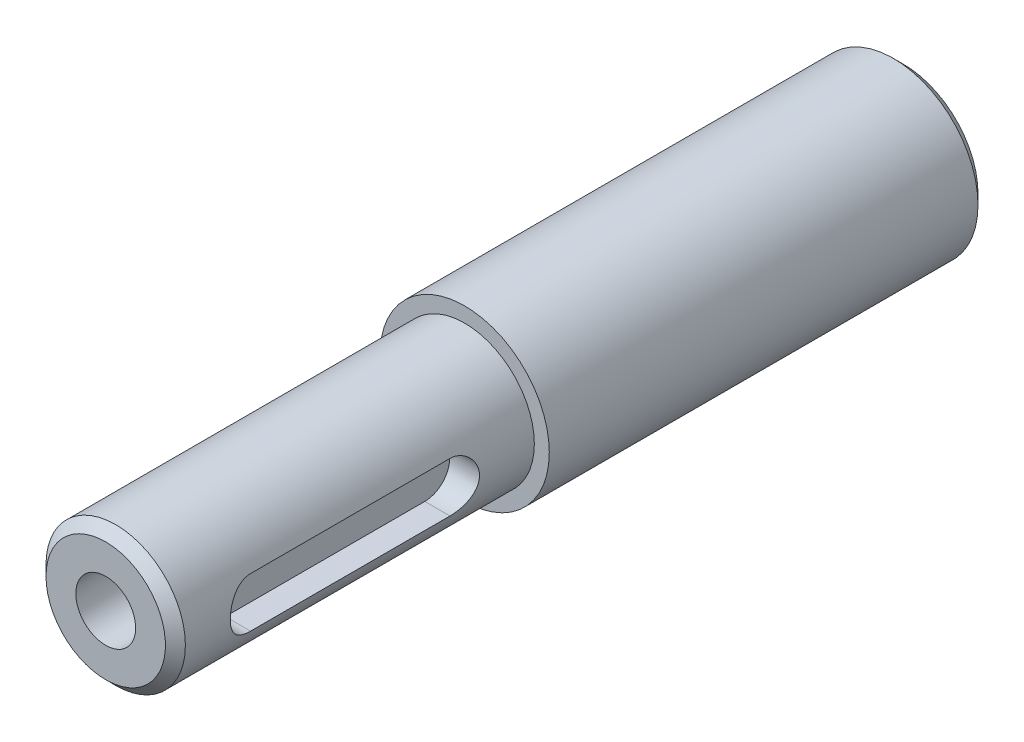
ISO-10303-21;
HEADER;
FILE_DESCRIPTION(('STEP AP214'),'2;1');
FILE_NAME('part.step','',(''),(''),'','','');
FILE_SCHEMA(('AUTOMOTIVE_DESIGN { 1 0 10303 214 1 1 1 1 }'));
ENDSEC;
DATA;
#1=APPLICATION_CONTEXT('core data for automotive mechanical design processes');
#2=APPLICATION_PROTOCOL_DEFINITION('international standard','automotive_design',2000,#1);
#3=PRODUCT_CONTEXT('',#1,'mechanical');
#4=PRODUCT('Part','Part','',(#3));
#5=PRODUCT_RELATED_PRODUCT_CATEGORY('part','',(#4));
#6=PRODUCT_DEFINITION_FORMATION('','',#4);
#7=PRODUCT_DEFINITION_CONTEXT('part definition',#1,'design');
#8=PRODUCT_DEFINITION('design','',#6,#7);
#9=PRODUCT_DEFINITION_SHAPE('','',#8);
#10=(LENGTH_UNIT() NAMED_UNIT(*) SI_UNIT(.MILLI.,.METRE.));
#11=(NAMED_UNIT(*) PLANE_ANGLE_UNIT() SI_UNIT($,.RADIAN.));
#12=(NAMED_UNIT(*) SI_UNIT($,.STERADIAN.) SOLID_ANGLE_UNIT());
#13=UNCERTAINTY_MEASURE_WITH_UNIT(LENGTH_MEASURE(1.E-05),#10,'distance_accuracy_value','');
#14=(GEOMETRIC_REPRESENTATION_CONTEXT(3) GLOBAL_UNCERTAINTY_ASSIGNED_CONTEXT((#13)) GLOBAL_UNIT_ASSIGNED_CONTEXT((#10,
#11,#12)) REPRESENTATION_CONTEXT('',''));
#15=CARTESIAN_POINT('',(0.,0.,0.));
#16=DIRECTION('',(0.,0.,1.));
#17=DIRECTION('',(1.,0.,0.));
#18=AXIS2_PLACEMENT_3D('',#15,#16,#17);
#19=CARTESIAN_POINT('',(0.,0.,55.));
#20=DIRECTION('',(0.,0.,1.));
#21=DIRECTION('',(1.,0.,0.));
#22=AXIS2_PLACEMENT_3D('',#19,#20,#21);
#23=CONICAL_SURFACE('',#22,3.,1.02974425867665);
#24=CARTESIAN_POINT('',(0.,0.,53.1974181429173));
#25=VERTEX_POINT('',#24);
#26=VERTEX_LOOP('',#25);
#27=FACE_BOUND('',#26,.T.);
#28=CARTESIAN_POINT('',(0.,0.,55.));
#29=DIRECTION('',(0.,0.,1.));
#30=DIRECTION('',(1.,0.,0.));
#31=AXIS2_PLACEMENT_3D('',#28,#29,#30);
#32=CIRCLE('',#31,3.);
#33=CARTESIAN_POINT('',(3.,0.,55.));
#34=VERTEX_POINT('',#33);
#35=EDGE_CURVE('E67',#34,#34,#32,.T.);
#36=ORIENTED_EDGE('',*,*,#35,.T.);
#37=EDGE_LOOP('',(#36));
#38=FACE_BOUND('',#37,.T.);
#39=ADVANCED_FACE('F16',(#27,#38),#23,.F.);
#40=CARTESIAN_POINT('',(0.,0.,80.));
#41=DIRECTION('',(0.,0.,-1.));
#42=DIRECTION('',(0.,1.,0.));
#43=AXIS2_PLACEMENT_3D('',#40,#41,#42);
#44=CYLINDRICAL_SURFACE('',#43,3.);
#45=ORIENTED_EDGE('',*,*,#35,.F.);
#46=EDGE_LOOP('',(#45));
#47=FACE_BOUND('',#46,.T.);
#48=CARTESIAN_POINT('',(0.,0.,80.));
#49=DIRECTION('',(0.,0.,-1.));
#50=DIRECTION('',(0.,1.,0.));
#51=AXIS2_PLACEMENT_3D('',#48,#49,#50);
#52=CIRCLE('',#51,3.);
#53=CARTESIAN_POINT('',(0.,3.,80.));
#54=VERTEX_POINT('',#53);
#55=EDGE_CURVE('E20',#54,#54,#52,.F.);
#56=ORIENTED_EDGE('',*,*,#55,.T.);
#57=EDGE_LOOP('',(#56));
#58=FACE_BOUND('',#57,.T.);
#59=ADVANCED_FACE('F18',(#47,#58),#44,.F.);
#60=CARTESIAN_POINT('',(4.,0.,62.));
#61=DIRECTION('',(1.,0.,0.));
#62=DIRECTION('',(0.,0.,-1.));
#63=AXIS2_PLACEMENT_3D('',#60,#61,#62);
#64=PLANE('',#63);
#65=CARTESIAN_POINT('',(4.,0.,52.));
#66=DIRECTION('',(1.,0.,0.));
#67=DIRECTION('',(0.,0.,-1.));
#68=AXIS2_PLACEMENT_3D('',#65,#66,#67);
#69=CIRCLE('',#68,2.5);
#70=CARTESIAN_POINT('',(4.,-2.5,52.));
#71=VERTEX_POINT('',#70);
#72=CARTESIAN_POINT('',(4.,2.5,52.));
#73=VERTEX_POINT('',#72);
#74=EDGE_CURVE('E59',#71,#73,#69,.T.);
#75=ORIENTED_EDGE('',*,*,#74,.T.);
#76=DIRECTION('',(0.,0.,1.));
#77=VECTOR('',#76,1.);
#78=CARTESIAN_POINT('',(4.,2.5,72.));
#79=LINE('',#78,#77);
#80=CARTESIAN_POINT('',(4.,2.5,72.));
#81=VERTEX_POINT('',#80);
#82=EDGE_CURVE('E71',#73,#81,#79,.T.);
#83=ORIENTED_EDGE('',*,*,#82,.T.);
#84=CARTESIAN_POINT('',(4.,0.,72.));
#85=DIRECTION('',(1.,0.,0.));
#86=DIRECTION('',(0.,0.,-1.));
#87=AXIS2_PLACEMENT_3D('',#84,#85,#86);
#88=CIRCLE('',#87,2.5);
#89=CARTESIAN_POINT('',(4.,-2.5,72.));
#90=VERTEX_POINT('',#89);
#91=EDGE_CURVE('E221',#81,#90,#88,.T.);
#92=ORIENTED_EDGE('',*,*,#91,.T.);
#93=DIRECTION('',(0.,0.,-1.));
#94=VECTOR('',#93,1.);
#95=CARTESIAN_POINT('',(4.,-2.5,52.));
#96=LINE('',#95,#94);
#97=EDGE_CURVE('E57',#90,#71,#96,.T.);
#98=ORIENTED_EDGE('',*,*,#97,.T.);
#99=EDGE_LOOP('',(#75,#83,#92,#98));
#100=FACE_BOUND('',#99,.T.);
#101=ADVANCED_FACE('F194',(#100),#64,.T.);
#102=CARTESIAN_POINT('',(0.,0.,80.));
#103=DIRECTION('',(0.,0.,-1.));
#104=DIRECTION('',(-1.,0.,0.));
#105=AXIS2_PLACEMENT_3D('',#102,#103,#104);
#106=PLANE('',#105);
#107=ORIENTED_EDGE('',*,*,#55,.F.);
#108=EDGE_LOOP('',(#107));
#109=FACE_BOUND('',#108,.T.);
#110=CARTESIAN_POINT('',(0.,0.,80.0000000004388));
#111=DIRECTION('',(0.,0.,-1.));
#112=DIRECTION('',(-1.,0.,0.));
#113=AXIS2_PLACEMENT_3D('',#110,#111,#112);
#114=CIRCLE('',#113,5.9900000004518);
#115=CARTESIAN_POINT('',(-5.9900000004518,0.,80.0000000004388));
#116=VERTEX_POINT('',#115);
#117=EDGE_CURVE('E217',#116,#116,#114,.T.);
#118=ORIENTED_EDGE('',*,*,#117,.F.);
#119=EDGE_LOOP('',(#118));
#120=FACE_BOUND('',#119,.T.);
#121=ADVANCED_FACE('F186',(#109,#120),#106,.F.);
#122=CARTESIAN_POINT('',(4.,2.5,72.));
#123=DIRECTION('',(0.,1.,0.));
#124=DIRECTION('',(0.,0.,1.));
#125=AXIS2_PLACEMENT_3D('',#122,#123,#124);
#126=PLANE('',#125);
#127=DIRECTION('',(1.,0.,0.));
#128=VECTOR('',#127,1.);
#129=CARTESIAN_POINT('',(4.,2.5,72.));
#130=LINE('',#129,#128);
#131=CARTESIAN_POINT('',(6.52764122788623,2.5,72.));
#132=VERTEX_POINT('',#131);
#133=EDGE_CURVE('E224',#132,#81,#130,.F.);
#134=ORIENTED_EDGE('',*,*,#133,.T.);
#135=ORIENTED_EDGE('',*,*,#82,.F.);
#136=DIRECTION('',(1.,0.,0.));
#137=VECTOR('',#136,1.);
#138=CARTESIAN_POINT('',(4.,2.5,52.));
#139=LINE('',#138,#137);
#140=CARTESIAN_POINT('',(6.52764122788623,2.5,52.));
#141=VERTEX_POINT('',#140);
#142=EDGE_CURVE('E225',#73,#141,#139,.T.);
#143=ORIENTED_EDGE('',*,*,#142,.T.);
#144=DIRECTION('',(0.,0.,1.));
#145=VECTOR('',#144,1.);
#146=CARTESIAN_POINT('',(6.52764122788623,2.5,44.));
#147=LINE('',#146,#145);
#148=EDGE_CURVE('E218',#132,#141,#147,.F.);
#149=ORIENTED_EDGE('',*,*,#148,.F.);
#150=EDGE_LOOP('',(#134,#135,#143,#149));
#151=FACE_BOUND('',#150,.T.);
#152=ADVANCED_FACE('F179',(#151),#126,.F.);
#153=CARTESIAN_POINT('',(4.,0.,52.));
#154=DIRECTION('',(1.,0.,0.));
#155=DIRECTION('',(0.,0.,-1.));
#156=AXIS2_PLACEMENT_3D('',#153,#154,#155);
#157=CYLINDRICAL_SURFACE('',#156,2.5);
#158=ORIENTED_EDGE('',*,*,#142,.F.);
#159=ORIENTED_EDGE('',*,*,#74,.F.);
#160=DIRECTION('',(1.,0.,0.));
#161=VECTOR('',#160,1.);
#162=CARTESIAN_POINT('',(4.,-2.5,52.));
#163=LINE('',#162,#161);
#164=CARTESIAN_POINT('',(6.52764122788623,-2.5,52.));
#165=VERTEX_POINT('',#164);
#166=EDGE_CURVE('E231',#71,#165,#163,.T.);
#167=ORIENTED_EDGE('',*,*,#166,.T.);
#168=CARTESIAN_POINT('',(6.52764122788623,2.5,52.));
#169=CARTESIAN_POINT('',(6.52762932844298,2.50000932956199,51.9321178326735));
#170=CARTESIAN_POINT('',(6.52869982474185,2.49723542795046,51.8642422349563));
#171=CARTESIAN_POINT('',(6.53291691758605,2.48619392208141,51.7290245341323));
#172=CARTESIAN_POINT('',(6.53606287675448,2.47792800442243,51.6616822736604));
#173=CARTESIAN_POINT('',(6.54432869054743,2.45601124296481,51.5282291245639));
#174=CARTESIAN_POINT('',(6.54944201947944,2.44237819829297,51.4621149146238));
#175=CARTESIAN_POINT('',(6.56147229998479,2.40987135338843,51.3313718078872));
#176=CARTESIAN_POINT('',(6.5683893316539,2.39099732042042,51.2667429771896));
#177=CARTESIAN_POINT('',(6.59153147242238,2.3267801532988,51.0758402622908));
#178=CARTESIAN_POINT('',(6.61016236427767,2.27380524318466,50.9523295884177));
#179=CARTESIAN_POINT('',(6.65171798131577,2.14919483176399,50.7159177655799));
#180=CARTESIAN_POINT('',(6.67464584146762,2.07754569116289,50.6030244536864));
#181=CARTESIAN_POINT('',(6.72336274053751,1.91416778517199,50.3859538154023));
#182=CARTESIAN_POINT('',(6.74923032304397,1.82173941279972,50.2823195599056));
#183=CARTESIAN_POINT('',(6.80025349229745,1.62091775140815,50.0916479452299));
#184=CARTESIAN_POINT('',(6.82540894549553,1.51252149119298,50.0046136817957));
#185=CARTESIAN_POINT('',(6.87310216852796,1.27875147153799,49.8470357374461));
#186=CARTESIAN_POINT('',(6.89553639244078,1.15295997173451,49.7770775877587));
#187=CARTESIAN_POINT('',(6.93431732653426,0.890455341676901,49.6595405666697));
#188=CARTESIAN_POINT('',(6.95066612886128,0.753745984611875,49.6119540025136));
#189=CARTESIAN_POINT('',(6.97487541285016,0.479024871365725,49.5423975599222));
#190=CARTESIAN_POINT('',(6.98304624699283,0.341278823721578,49.5194883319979));
#191=CARTESIAN_POINT('',(6.99108762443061,0.0636687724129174,49.4969369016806));
#192=CARTESIAN_POINT('',(6.99096047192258,-0.0761946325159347,49.4972882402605));
#193=CARTESIAN_POINT('',(6.98262286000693,-0.347368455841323,49.5206807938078));
#194=CARTESIAN_POINT('',(6.97477696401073,-0.478780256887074,49.5426986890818));
#195=CARTESIAN_POINT('',(6.95235298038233,-0.735901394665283,49.6070901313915));
#196=CARTESIAN_POINT('',(6.93777451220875,-0.861610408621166,49.6494648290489));
#197=CARTESIAN_POINT('',(6.90308940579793,-1.10584718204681,49.7538935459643));
#198=CARTESIAN_POINT('',(6.88290798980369,-1.22424926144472,49.816215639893));
#199=CARTESIAN_POINT('',(6.83908468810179,-1.44919738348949,49.9585408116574));
#200=CARTESIAN_POINT('',(6.81544174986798,-1.55573980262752,50.0385492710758));
#201=CARTESIAN_POINT('',(6.76566074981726,-1.75999327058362,50.2189963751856));
#202=CARTESIAN_POINT('',(6.73945687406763,-1.85692513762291,50.3203000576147));
#203=CARTESIAN_POINT('',(6.68853967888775,-2.03271605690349,50.5379342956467));
#204=CARTESIAN_POINT('',(6.6638268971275,-2.11156861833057,50.6542702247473));
#205=CARTESIAN_POINT('',(6.61829017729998,-2.25028518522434,50.9015041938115));
#206=CARTESIAN_POINT('',(6.5975494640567,-2.30975805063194,51.0326377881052));
#207=CARTESIAN_POINT('',(6.56327947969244,-2.40542819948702,51.3039263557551));
#208=CARTESIAN_POINT('',(6.54973844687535,-2.44166346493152,51.4440661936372));
#209=CARTESIAN_POINT('',(6.53641062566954,-2.47700740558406,51.6546749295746));
#210=CARTESIAN_POINT('',(6.53313324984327,-2.4856236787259,51.7234505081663));
#211=CARTESIAN_POINT('',(6.52874601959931,-2.49711753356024,51.8614711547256));
#212=CARTESIAN_POINT('',(6.52763377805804,-2.50000143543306,51.9307156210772));
#213=CARTESIAN_POINT('',(6.52764122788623,-2.5,52.));
#214=B_SPLINE_CURVE_WITH_KNOTS('',3,(#168,#169,#170,#171,#172,#173,#174,#175,#176,#177,#178,
#179,#180,#181,#182,#183,#184,#185,#186,#187,#188,#189,#190,#191,#192,#193,#194,#195,#196,#197,
#198,#199,#200,#201,#202,#203,#204,#205,#206,#207,#208,#209,#210,#211,#212,#213),.UNSPECIFIED.,
.F.,.F.,(4,2,2,2,2,2,2,2,2,2,2,2,2,2,2,2,2,2,2,2,2,2,4),(0.,0.20357036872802,0.407078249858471,
0.609916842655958,0.812764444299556,1.21779583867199,1.62312389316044,2.04497874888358,
2.46691219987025,2.90174567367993,3.33642951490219,3.75390878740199,4.17127213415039,
4.5698254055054,4.96840120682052,5.37257581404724,5.77687357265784,6.20283626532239,
6.62895164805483,7.06319987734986,7.49673650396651,7.7046723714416,7.91237885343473),.UNSPECIFIED.);
#215=EDGE_CURVE('E95',#141,#165,#214,.T.);
#216=ORIENTED_EDGE('',*,*,#215,.F.);
#217=EDGE_LOOP('',(#158,#159,#167,#216));
#218=FACE_BOUND('',#217,.T.);
#219=ADVANCED_FACE('F173',(#218),#157,.F.);
#220=CARTESIAN_POINT('',(4.,-2.5,52.));
#221=DIRECTION('',(0.,-1.,0.));
#222=DIRECTION('',(0.,0.,-1.));
#223=AXIS2_PLACEMENT_3D('',#220,#221,#222);
#224=PLANE('',#223);
#225=ORIENTED_EDGE('',*,*,#166,.F.);
#226=ORIENTED_EDGE('',*,*,#97,.F.);
#227=DIRECTION('',(1.,0.,0.));
#228=VECTOR('',#227,1.);
#229=CARTESIAN_POINT('',(4.,-2.5,72.));
#230=LINE('',#229,#228);
#231=CARTESIAN_POINT('',(6.52764122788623,-2.5,72.));
#232=VERTEX_POINT('',#231);
#233=EDGE_CURVE('E35',#90,#232,#230,.T.);
#234=ORIENTED_EDGE('',*,*,#233,.T.);
#235=DIRECTION('',(0.,0.,1.));
#236=VECTOR('',#235,1.);
#237=CARTESIAN_POINT('',(6.52764122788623,-2.5,44.));
#238=LINE('',#237,#236);
#239=EDGE_CURVE('E94',#165,#232,#238,.T.);
#240=ORIENTED_EDGE('',*,*,#239,.F.);
#241=EDGE_LOOP('',(#225,#226,#234,#240));
#242=FACE_BOUND('',#241,.T.);
#243=ADVANCED_FACE('F120',(#242),#224,.F.);
#244=CARTESIAN_POINT('',(4.,0.,72.));
#245=DIRECTION('',(1.,0.,0.));
#246=DIRECTION('',(0.,0.,-1.));
#247=AXIS2_PLACEMENT_3D('',#244,#245,#246);
#248=CYLINDRICAL_SURFACE('',#247,2.5);
#249=ORIENTED_EDGE('',*,*,#233,.F.);
#250=ORIENTED_EDGE('',*,*,#91,.F.);
#251=ORIENTED_EDGE('',*,*,#133,.F.);
#252=CARTESIAN_POINT('',(6.52764122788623,-2.5,72.));
#253=CARTESIAN_POINT('',(6.52762932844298,-2.50000932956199,72.0678821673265));
#254=CARTESIAN_POINT('',(6.52869982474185,-2.49723542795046,72.1357577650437));
#255=CARTESIAN_POINT('',(6.53291691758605,-2.48619392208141,72.2709754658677));
#256=CARTESIAN_POINT('',(6.53606287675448,-2.47792800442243,72.3383177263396));
#257=CARTESIAN_POINT('',(6.54432869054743,-2.45601124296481,72.4717708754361));
#258=CARTESIAN_POINT('',(6.54944201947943,-2.44237819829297,72.5378850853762));
#259=CARTESIAN_POINT('',(6.56147229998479,-2.40987135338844,72.6686281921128));
#260=CARTESIAN_POINT('',(6.5683893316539,-2.39099732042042,72.7332570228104));
#261=CARTESIAN_POINT('',(6.59153147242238,-2.3267801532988,72.9241597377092));
#262=CARTESIAN_POINT('',(6.61016236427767,-2.27380524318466,73.0476704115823));
#263=CARTESIAN_POINT('',(6.65171798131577,-2.14919483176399,73.2840822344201));
#264=CARTESIAN_POINT('',(6.67464584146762,-2.07754569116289,73.3969755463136));
#265=CARTESIAN_POINT('',(6.72336274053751,-1.914167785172,73.6140461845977));
#266=CARTESIAN_POINT('',(6.74923032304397,-1.82173941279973,73.7176804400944));
#267=CARTESIAN_POINT('',(6.80025349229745,-1.62091775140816,73.9083520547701));
#268=CARTESIAN_POINT('',(6.82540894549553,-1.51252149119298,73.9953863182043));
#269=CARTESIAN_POINT('',(6.87310216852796,-1.27875147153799,74.152964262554));
#270=CARTESIAN_POINT('',(6.89553639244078,-1.1529599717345,74.2229224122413));
#271=CARTESIAN_POINT('',(6.93431732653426,-0.890455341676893,74.3404594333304));
#272=CARTESIAN_POINT('',(6.95066612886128,-0.753745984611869,74.3880459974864));
#273=CARTESIAN_POINT('',(6.97487541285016,-0.47902487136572,74.4576024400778));
#274=CARTESIAN_POINT('',(6.98304624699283,-0.341278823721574,74.4805116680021));
#275=CARTESIAN_POINT('',(6.99108762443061,-0.0636687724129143,74.5030630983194));
#276=CARTESIAN_POINT('',(6.99096047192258,0.0761946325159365,74.5027117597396));
#277=CARTESIAN_POINT('',(6.98262286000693,0.347368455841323,74.4793192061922));
#278=CARTESIAN_POINT('',(6.97477696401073,0.478780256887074,74.4573013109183));
#279=CARTESIAN_POINT('',(6.95235298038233,0.735901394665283,74.3929098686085));
#280=CARTESIAN_POINT('',(6.93777451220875,0.861610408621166,74.3505351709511));
#281=CARTESIAN_POINT('',(6.90308940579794,1.10584718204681,74.2461064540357));
#282=CARTESIAN_POINT('',(6.88290798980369,1.22424926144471,74.183784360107));
#283=CARTESIAN_POINT('',(6.83908468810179,1.44919738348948,74.0414591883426));
#284=CARTESIAN_POINT('',(6.81544174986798,1.55573980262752,73.9614507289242));
#285=CARTESIAN_POINT('',(6.76566074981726,1.75999327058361,73.7810036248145));
#286=CARTESIAN_POINT('',(6.73945687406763,1.85692513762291,73.6796999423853));
#287=CARTESIAN_POINT('',(6.68853967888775,2.03271605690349,73.4620657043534));
#288=CARTESIAN_POINT('',(6.6638268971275,2.11156861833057,73.3457297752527));
#289=CARTESIAN_POINT('',(6.61829017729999,2.25028518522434,73.0984958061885));
#290=CARTESIAN_POINT('',(6.5975494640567,2.30975805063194,72.9673622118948));
#291=CARTESIAN_POINT('',(6.56327947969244,2.40542819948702,72.6960736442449));
#292=CARTESIAN_POINT('',(6.54973844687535,2.44166346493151,72.5559338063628));
#293=CARTESIAN_POINT('',(6.53641062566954,2.47700740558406,72.3453250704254));
#294=CARTESIAN_POINT('',(6.53313324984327,2.4856236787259,72.2765494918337));
#295=CARTESIAN_POINT('',(6.52874601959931,2.49711753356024,72.1385288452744));
#296=CARTESIAN_POINT('',(6.52763377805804,2.50000143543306,72.0692843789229));
#297=CARTESIAN_POINT('',(6.52764122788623,2.5,72.));
#298=B_SPLINE_CURVE_WITH_KNOTS('',3,(#252,#253,#254,#255,#256,#257,#258,#259,#260,#261,#262,
#263,#264,#265,#266,#267,#268,#269,#270,#271,#272,#273,#274,#275,#276,#277,#278,#279,#280,#281,
#282,#283,#284,#285,#286,#287,#288,#289,#290,#291,#292,#293,#294,#295,#296,#297),.UNSPECIFIED.,
.F.,.F.,(4,2,2,2,2,2,2,2,2,2,2,2,2,2,2,2,2,2,2,2,2,2,4),(0.,0.20357036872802,0.407078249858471,
0.609916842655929,0.812764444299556,1.21779583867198,1.62312389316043,2.04497874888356,
2.46691219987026,2.90174567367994,3.3364295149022,3.75390878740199,4.17127213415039,
4.5698254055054,4.96840120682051,5.37257581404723,5.77687357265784,6.2028362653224,
6.62895164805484,7.06319987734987,7.4967365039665,7.70467237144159,7.91237885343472),.UNSPECIFIED.);
#299=EDGE_CURVE('E86',#232,#132,#298,.T.);
#300=ORIENTED_EDGE('',*,*,#299,.F.);
#301=EDGE_LOOP('',(#249,#250,#251,#300));
#302=FACE_BOUND('',#301,.T.);
#303=ADVANCED_FACE('F101',(#302),#248,.F.);
#304=CARTESIAN_POINT('',(0.,0.,78.999999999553));
#305=DIRECTION('',(0.,0.,-1.));
#306=DIRECTION('',(-1.,0.,0.));
#307=AXIS2_PLACEMENT_3D('',#304,#305,#306);
#308=CONICAL_SURFACE('',#307,6.9899999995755,0.785398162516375);
#309=CARTESIAN_POINT('',(0.,0.,79.));
#310=DIRECTION('',(0.,0.,1.));
#311=DIRECTION('',(1.,0.,0.));
#312=AXIS2_PLACEMENT_3D('',#309,#310,#311);
#313=CIRCLE('',#312,6.99);
#314=CARTESIAN_POINT('',(6.99,0.,79.));
#315=VERTEX_POINT('',#314);
#316=EDGE_CURVE('E85',#315,#315,#313,.F.);
#317=ORIENTED_EDGE('',*,*,#316,.F.);
#318=EDGE_LOOP('',(#317));
#319=FACE_BOUND('',#318,.T.);
#320=ORIENTED_EDGE('',*,*,#117,.T.);
#321=EDGE_LOOP('',(#320));
#322=FACE_BOUND('',#321,.T.);
#323=ADVANCED_FACE('F110',(#319,#322),#308,.T.);
#324=CARTESIAN_POINT('',(0.,0.,44.));
#325=DIRECTION('',(0.,0.,1.));
#326=DIRECTION('',(1.,0.,0.));
#327=AXIS2_PLACEMENT_3D('',#324,#325,#326);
#328=CYLINDRICAL_SURFACE('',#327,6.99);
#329=ORIENTED_EDGE('',*,*,#316,.T.);
#330=EDGE_LOOP('',(#329));
#331=FACE_BOUND('',#330,.T.);
#332=ORIENTED_EDGE('',*,*,#239,.T.);
#333=ORIENTED_EDGE('',*,*,#299,.T.);
#334=ORIENTED_EDGE('',*,*,#148,.T.);
#335=ORIENTED_EDGE('',*,*,#215,.T.);
#336=EDGE_LOOP('',(#332,#333,#334,#335));
#337=FACE_BOUND('',#336,.T.);
#338=CARTESIAN_POINT('',(0.,0.,44.));
#339=DIRECTION('',(0.,0.,1.));
#340=DIRECTION('',(1.,0.,0.));
#341=AXIS2_PLACEMENT_3D('',#338,#339,#340);
#342=CIRCLE('',#341,6.99);
#343=CARTESIAN_POINT('',(6.99,0.,44.));
#344=VERTEX_POINT('',#343);
#345=EDGE_CURVE('E82',#344,#344,#342,.T.);
#346=ORIENTED_EDGE('',*,*,#345,.T.);
#347=EDGE_LOOP('',(#346));
#348=FACE_BOUND('',#347,.T.);
#349=ADVANCED_FACE('F105',(#331,#337,#348),#328,.T.);
#350=CARTESIAN_POINT('',(0.,0.,0.));
#351=DIRECTION('',(0.,0.,-1.));
#352=DIRECTION('',(-1.,0.,0.));
#353=AXIS2_PLACEMENT_3D('',#350,#351,#352);
#354=PLANE('',#353);
#355=CARTESIAN_POINT('',(0.,0.,-4.48725258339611E-10));
#356=DIRECTION('',(0.,0.,1.));
#357=DIRECTION('',(1.,0.,0.));
#358=AXIS2_PLACEMENT_3D('',#355,#356,#357);
#359=CIRCLE('',#358,7.49000000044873);
#360=CARTESIAN_POINT('',(7.49000000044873,0.,-4.48725258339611E-10));
#361=VERTEX_POINT('',#360);
#362=EDGE_CURVE('E79',#361,#361,#359,.T.);
#363=ORIENTED_EDGE('',*,*,#362,.F.);
#364=EDGE_LOOP('',(#363));
#365=FACE_BOUND('',#364,.T.);
#366=ADVANCED_FACE('F109',(#365),#354,.T.);
#367=CARTESIAN_POINT('',(0.,0.,44.));
#368=DIRECTION('',(0.,0.,-1.));
#369=DIRECTION('',(-1.,0.,0.));
#370=AXIS2_PLACEMENT_3D('',#367,#368,#369);
#371=PLANE('',#370);
#372=ORIENTED_EDGE('',*,*,#345,.F.);
#373=EDGE_LOOP('',(#372));
#374=FACE_BOUND('',#373,.T.);
#375=CARTESIAN_POINT('',(0.,0.,44.));
#376=DIRECTION('',(0.,0.,1.));
#377=DIRECTION('',(1.,0.,0.));
#378=AXIS2_PLACEMENT_3D('',#375,#376,#377);
#379=CIRCLE('',#378,8.49);
#380=CARTESIAN_POINT('',(8.49,0.,44.));
#381=VERTEX_POINT('',#380);
#382=EDGE_CURVE('E26',#381,#381,#379,.F.);
#383=ORIENTED_EDGE('',*,*,#382,.F.);
#384=EDGE_LOOP('',(#383));
#385=FACE_BOUND('',#384,.T.);
#386=ADVANCED_FACE('F132',(#374,#385),#371,.F.);
#387=CARTESIAN_POINT('',(0.,0.,1.00000000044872));
#388=DIRECTION('',(0.,0.,1.));
#389=DIRECTION('',(1.,0.,0.));
#390=AXIS2_PLACEMENT_3D('',#387,#388,#389);
#391=CONICAL_SURFACE('',#390,8.48999999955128,0.785398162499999);
#392=ORIENTED_EDGE('',*,*,#362,.T.);
#393=EDGE_LOOP('',(#392));
#394=FACE_BOUND('',#393,.T.);
#395=CARTESIAN_POINT('',(0.,0.,1.));
#396=DIRECTION('',(0.,0.,1.));
#397=DIRECTION('',(1.,0.,0.));
#398=AXIS2_PLACEMENT_3D('',#395,#396,#397);
#399=CIRCLE('',#398,8.49);
#400=CARTESIAN_POINT('',(8.49,0.,1.));
#401=VERTEX_POINT('',#400);
#402=EDGE_CURVE('E11',#401,#401,#399,.T.);
#403=ORIENTED_EDGE('',*,*,#402,.F.);
#404=EDGE_LOOP('',(#403));
#405=FACE_BOUND('',#404,.T.);
#406=ADVANCED_FACE('F126',(#394,#405),#391,.T.);
#407=CARTESIAN_POINT('',(0.,0.,0.));
#408=DIRECTION('',(0.,0.,1.));
#409=DIRECTION('',(1.,0.,0.));
#410=AXIS2_PLACEMENT_3D('',#407,#408,#409);
#411=CYLINDRICAL_SURFACE('',#410,8.49);
#412=ORIENTED_EDGE('',*,*,#402,.T.);
#413=EDGE_LOOP('',(#412));
#414=FACE_BOUND('',#413,.T.);
#415=ORIENTED_EDGE('',*,*,#382,.T.);
#416=EDGE_LOOP('',(#415));
#417=FACE_BOUND('',#416,.T.);
#418=ADVANCED_FACE('F124',(#414,#417),#411,.T.);
#419=CLOSED_SHELL('',(#39,#59,#101,#121,#152,#219,#243,#303,#323,#349,#366,#386,#406,#418));
#420=MANIFOLD_SOLID_BREP('B1',#419);
#421=ADVANCED_BREP_SHAPE_REPRESENTATION('',(#18,#420),#14);
#422=SHAPE_DEFINITION_REPRESENTATION(#9,#421);
ENDSEC;
END-ISO-10303-21;
